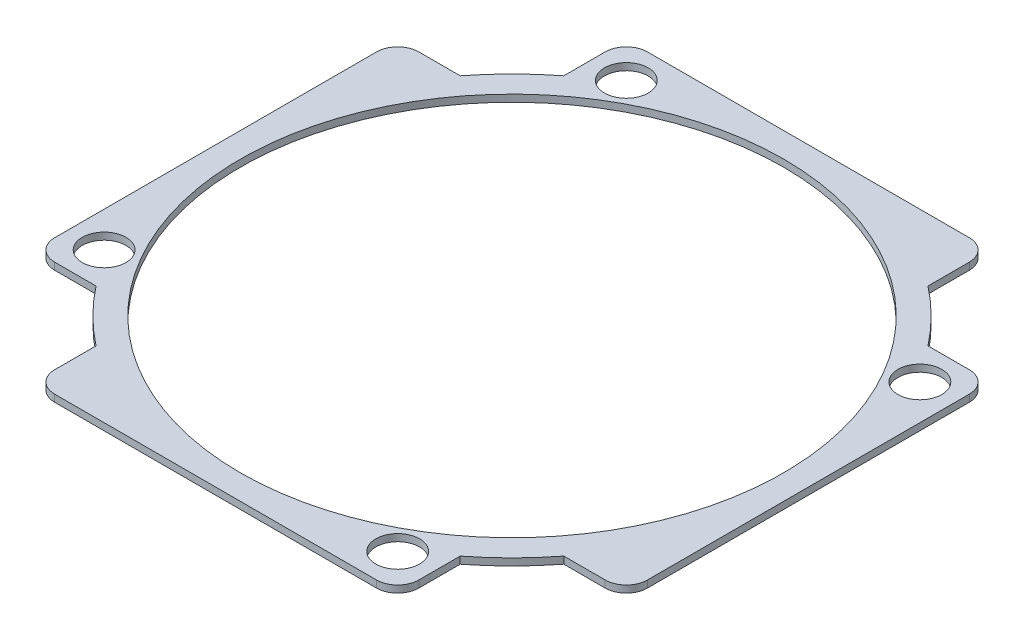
ISO-10303-21;
HEADER;
FILE_DESCRIPTION(('STEP AP214'),'2;1');
FILE_NAME('part.step','',(''),(''),'','','');
FILE_SCHEMA(('AUTOMOTIVE_DESIGN { 1 0 10303 214 1 1 1 1 }'));
ENDSEC;
DATA;
#1=APPLICATION_CONTEXT('core data for automotive mechanical design processes');
#2=APPLICATION_PROTOCOL_DEFINITION('international standard','automotive_design',2000,#1);
#3=PRODUCT_CONTEXT('',#1,'mechanical');
#4=PRODUCT('Part','Part','',(#3));
#5=PRODUCT_RELATED_PRODUCT_CATEGORY('part','',(#4));
#6=PRODUCT_DEFINITION_FORMATION('','',#4);
#7=PRODUCT_DEFINITION_CONTEXT('part definition',#1,'design');
#8=PRODUCT_DEFINITION('design','',#6,#7);
#9=PRODUCT_DEFINITION_SHAPE('','',#8);
#10=(LENGTH_UNIT() NAMED_UNIT(*) SI_UNIT(.MILLI.,.METRE.));
#11=(NAMED_UNIT(*) PLANE_ANGLE_UNIT() SI_UNIT($,.RADIAN.));
#12=(NAMED_UNIT(*) SI_UNIT($,.STERADIAN.) SOLID_ANGLE_UNIT());
#13=UNCERTAINTY_MEASURE_WITH_UNIT(LENGTH_MEASURE(1.E-05),#10,'distance_accuracy_value','');
#14=(GEOMETRIC_REPRESENTATION_CONTEXT(3) GLOBAL_UNCERTAINTY_ASSIGNED_CONTEXT((#13)) GLOBAL_UNIT_ASSIGNED_CONTEXT((#10,
#11,#12)) REPRESENTATION_CONTEXT('',''));
#15=CARTESIAN_POINT('',(0.,0.,0.));
#16=DIRECTION('',(0.,0.,1.));
#17=DIRECTION('',(1.,0.,0.));
#18=AXIS2_PLACEMENT_3D('',#15,#16,#17);
#19=CARTESIAN_POINT('',(-11.4,0.,19.5));
#20=DIRECTION('',(0.,1.,0.));
#21=DIRECTION('',(0.,0.,1.));
#22=AXIS2_PLACEMENT_3D('',#19,#20,#21);
#23=CYLINDRICAL_SURFACE('',#22,1.5);
#24=CARTESIAN_POINT('',(-11.4,0.499999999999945,19.5));
#25=DIRECTION('',(0.,1.,0.));
#26=DIRECTION('',(0.,0.,1.));
#27=AXIS2_PLACEMENT_3D('',#24,#25,#26);
#28=CIRCLE('',#27,1.5);
#29=CARTESIAN_POINT('',(-12.9,0.499999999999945,19.5));
#30=VERTEX_POINT('',#29);
#31=CARTESIAN_POINT('',(-11.4,0.499999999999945,21.));
#32=VERTEX_POINT('',#31);
#33=EDGE_CURVE('E225',#30,#32,#28,.T.);
#34=ORIENTED_EDGE('',*,*,#33,.F.);
#35=DIRECTION('',(0.,1.,0.));
#36=VECTOR('',#35,1.);
#37=CARTESIAN_POINT('',(-12.9,0.,19.5));
#38=LINE('',#37,#36);
#39=CARTESIAN_POINT('',(-12.9,0.,19.5));
#40=VERTEX_POINT('',#39);
#41=EDGE_CURVE('E11',#40,#30,#38,.T.);
#42=ORIENTED_EDGE('',*,*,#41,.F.);
#43=CARTESIAN_POINT('',(-11.4,0.,19.5));
#44=DIRECTION('',(0.,1.,0.));
#45=DIRECTION('',(0.,0.,1.));
#46=AXIS2_PLACEMENT_3D('',#43,#44,#45);
#47=CIRCLE('',#46,1.5);
#48=CARTESIAN_POINT('',(-11.4,0.,21.));
#49=VERTEX_POINT('',#48);
#50=EDGE_CURVE('E294',#40,#49,#47,.T.);
#51=ORIENTED_EDGE('',*,*,#50,.T.);
#52=DIRECTION('',(0.,1.,0.));
#53=VECTOR('',#52,1.);
#54=CARTESIAN_POINT('',(-11.4,0.,21.));
#55=LINE('',#54,#53);
#56=EDGE_CURVE('E35',#49,#32,#55,.T.);
#57=ORIENTED_EDGE('',*,*,#56,.T.);
#58=EDGE_LOOP('',(#34,#42,#51,#57));
#59=FACE_BOUND('',#58,.T.);
#60=ADVANCED_FACE('F32',(#59),#23,.T.);
#61=CARTESIAN_POINT('',(-12.9,0.,16.5707573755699));
#62=DIRECTION('',(-1.,0.,0.));
#63=DIRECTION('',(0.,0.,1.));
#64=AXIS2_PLACEMENT_3D('',#61,#62,#63);
#65=PLANE('',#64);
#66=DIRECTION('',(0.,0.,1.));
#67=VECTOR('',#66,1.);
#68=CARTESIAN_POINT('',(-12.9,0.499999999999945,16.5707573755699));
#69=LINE('',#68,#67);
#70=CARTESIAN_POINT('',(-12.9,0.499999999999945,16.5707573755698));
#71=VERTEX_POINT('',#70);
#72=EDGE_CURVE('E292',#71,#30,#69,.T.);
#73=ORIENTED_EDGE('',*,*,#72,.F.);
#74=DIRECTION('',(0.,1.,0.));
#75=VECTOR('',#74,1.);
#76=CARTESIAN_POINT('',(-12.9,0.,16.5707573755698));
#77=LINE('',#76,#75);
#78=CARTESIAN_POINT('',(-12.9,0.,16.5707573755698));
#79=VERTEX_POINT('',#78);
#80=EDGE_CURVE('E41',#79,#71,#77,.T.);
#81=ORIENTED_EDGE('',*,*,#80,.F.);
#82=DIRECTION('',(0.,0.,1.));
#83=VECTOR('',#82,1.);
#84=CARTESIAN_POINT('',(-12.9,0.,16.5707573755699));
#85=LINE('',#84,#83);
#86=EDGE_CURVE('E215',#79,#40,#85,.T.);
#87=ORIENTED_EDGE('',*,*,#86,.T.);
#88=ORIENTED_EDGE('',*,*,#41,.T.);
#89=EDGE_LOOP('',(#73,#81,#87,#88));
#90=FACE_BOUND('',#89,.T.);
#91=ADVANCED_FACE('F338',(#90),#65,.T.);
#92=CARTESIAN_POINT('',(0.,0.,0.));
#93=DIRECTION('',(0.,1.,0.));
#94=DIRECTION('',(0.,0.,1.));
#95=AXIS2_PLACEMENT_3D('',#92,#93,#94);
#96=CYLINDRICAL_SURFACE('',#95,21.);
#97=CARTESIAN_POINT('',(0.,0.499999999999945,0.));
#98=DIRECTION('',(0.,1.,0.));
#99=DIRECTION('',(0.,0.,1.));
#100=AXIS2_PLACEMENT_3D('',#97,#98,#99);
#101=CIRCLE('',#100,21.);
#102=CARTESIAN_POINT('',(-16.5707573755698,0.499999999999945,12.8999999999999));
#103=VERTEX_POINT('',#102);
#104=EDGE_CURVE('E202',#103,#71,#101,.T.);
#105=ORIENTED_EDGE('',*,*,#104,.F.);
#106=DIRECTION('',(0.,1.,0.));
#107=VECTOR('',#106,1.);
#108=CARTESIAN_POINT('',(-16.5707573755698,0.,12.8999999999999));
#109=LINE('',#108,#107);
#110=CARTESIAN_POINT('',(-16.5707573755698,0.,12.8999999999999));
#111=VERTEX_POINT('',#110);
#112=EDGE_CURVE('E197',#111,#103,#109,.T.);
#113=ORIENTED_EDGE('',*,*,#112,.F.);
#114=CARTESIAN_POINT('',(0.,0.,0.));
#115=DIRECTION('',(0.,1.,0.));
#116=DIRECTION('',(0.,0.,1.));
#117=AXIS2_PLACEMENT_3D('',#114,#115,#116);
#118=CIRCLE('',#117,21.);
#119=EDGE_CURVE('E200',#111,#79,#118,.T.);
#120=ORIENTED_EDGE('',*,*,#119,.T.);
#121=ORIENTED_EDGE('',*,*,#80,.T.);
#122=EDGE_LOOP('',(#105,#113,#120,#121));
#123=FACE_BOUND('',#122,.T.);
#124=ADVANCED_FACE('F199',(#123),#96,.T.);
#125=CARTESIAN_POINT('',(-19.5,0.,12.9));
#126=DIRECTION('',(0.,0.,1.));
#127=DIRECTION('',(1.,0.,0.));
#128=AXIS2_PLACEMENT_3D('',#125,#126,#127);
#129=PLANE('',#128);
#130=DIRECTION('',(1.,0.,0.));
#131=VECTOR('',#130,1.);
#132=CARTESIAN_POINT('',(-19.5,0.499999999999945,12.9));
#133=LINE('',#132,#131);
#134=CARTESIAN_POINT('',(-19.5,0.499999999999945,12.9));
#135=VERTEX_POINT('',#134);
#136=EDGE_CURVE('E289',#135,#103,#133,.T.);
#137=ORIENTED_EDGE('',*,*,#136,.F.);
#138=DIRECTION('',(0.,1.,0.));
#139=VECTOR('',#138,1.);
#140=CARTESIAN_POINT('',(-19.5,0.,12.9));
#141=LINE('',#140,#139);
#142=CARTESIAN_POINT('',(-19.5,0.,12.9));
#143=VERTEX_POINT('',#142);
#144=EDGE_CURVE('E207',#143,#135,#141,.T.);
#145=ORIENTED_EDGE('',*,*,#144,.F.);
#146=DIRECTION('',(1.,0.,0.));
#147=VECTOR('',#146,1.);
#148=CARTESIAN_POINT('',(-19.5,0.,12.9));
#149=LINE('',#148,#147);
#150=EDGE_CURVE('E213',#143,#111,#149,.T.);
#151=ORIENTED_EDGE('',*,*,#150,.T.);
#152=ORIENTED_EDGE('',*,*,#112,.T.);
#153=EDGE_LOOP('',(#137,#145,#151,#152));
#154=FACE_BOUND('',#153,.T.);
#155=ADVANCED_FACE('F217',(#154),#129,.T.);
#156=CARTESIAN_POINT('',(-19.5,0.,11.4));
#157=DIRECTION('',(0.,1.,0.));
#158=DIRECTION('',(0.,0.,1.));
#159=AXIS2_PLACEMENT_3D('',#156,#157,#158);
#160=CYLINDRICAL_SURFACE('',#159,1.5);
#161=CARTESIAN_POINT('',(-19.5,0.499999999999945,11.4));
#162=DIRECTION('',(0.,1.,0.));
#163=DIRECTION('',(0.,0.,1.));
#164=AXIS2_PLACEMENT_3D('',#161,#162,#163);
#165=CIRCLE('',#164,1.5);
#166=CARTESIAN_POINT('',(-21.,0.499999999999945,11.4));
#167=VERTEX_POINT('',#166);
#168=EDGE_CURVE('E286',#167,#135,#165,.T.);
#169=ORIENTED_EDGE('',*,*,#168,.F.);
#170=DIRECTION('',(0.,1.,0.));
#171=VECTOR('',#170,1.);
#172=CARTESIAN_POINT('',(-21.,0.,11.4));
#173=LINE('',#172,#171);
#174=CARTESIAN_POINT('',(-21.,0.,11.4));
#175=VERTEX_POINT('',#174);
#176=EDGE_CURVE('E298',#175,#167,#173,.T.);
#177=ORIENTED_EDGE('',*,*,#176,.F.);
#178=CARTESIAN_POINT('',(-19.5,0.,11.4));
#179=DIRECTION('',(0.,1.,0.));
#180=DIRECTION('',(0.,0.,1.));
#181=AXIS2_PLACEMENT_3D('',#178,#179,#180);
#182=CIRCLE('',#181,1.5);
#183=EDGE_CURVE('E218',#175,#143,#182,.T.);
#184=ORIENTED_EDGE('',*,*,#183,.T.);
#185=ORIENTED_EDGE('',*,*,#144,.T.);
#186=EDGE_LOOP('',(#169,#177,#184,#185));
#187=FACE_BOUND('',#186,.T.);
#188=ADVANCED_FACE('F351',(#187),#160,.T.);
#189=CARTESIAN_POINT('',(-21.,0.,-11.4));
#190=DIRECTION('',(-1.,0.,0.));
#191=DIRECTION('',(0.,0.,1.));
#192=AXIS2_PLACEMENT_3D('',#189,#190,#191);
#193=PLANE('',#192);
#194=DIRECTION('',(0.,0.,1.));
#195=VECTOR('',#194,1.);
#196=CARTESIAN_POINT('',(-21.,0.499999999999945,-11.4));
#197=LINE('',#196,#195);
#198=CARTESIAN_POINT('',(-21.,0.499999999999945,-11.4));
#199=VERTEX_POINT('',#198);
#200=EDGE_CURVE('E283',#199,#167,#197,.T.);
#201=ORIENTED_EDGE('',*,*,#200,.F.);
#202=DIRECTION('',(0.,1.,0.));
#203=VECTOR('',#202,1.);
#204=CARTESIAN_POINT('',(-21.,0.,-11.4));
#205=LINE('',#204,#203);
#206=CARTESIAN_POINT('',(-21.,0.,-11.4));
#207=VERTEX_POINT('',#206);
#208=EDGE_CURVE('E300',#207,#199,#205,.T.);
#209=ORIENTED_EDGE('',*,*,#208,.F.);
#210=DIRECTION('',(0.,0.,1.));
#211=VECTOR('',#210,1.);
#212=CARTESIAN_POINT('',(-21.,0.,-11.4));
#213=LINE('',#212,#211);
#214=EDGE_CURVE('E220',#207,#175,#213,.T.);
#215=ORIENTED_EDGE('',*,*,#214,.T.);
#216=ORIENTED_EDGE('',*,*,#176,.T.);
#217=EDGE_LOOP('',(#201,#209,#215,#216));
#218=FACE_BOUND('',#217,.T.);
#219=ADVANCED_FACE('F354',(#218),#193,.T.);
#220=CARTESIAN_POINT('',(-19.5,0.,-11.4));
#221=DIRECTION('',(0.,1.,0.));
#222=DIRECTION('',(0.,0.,1.));
#223=AXIS2_PLACEMENT_3D('',#220,#221,#222);
#224=CYLINDRICAL_SURFACE('',#223,1.5);
#225=CARTESIAN_POINT('',(-19.5,0.499999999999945,-11.4));
#226=DIRECTION('',(0.,1.,0.));
#227=DIRECTION('',(0.,0.,1.));
#228=AXIS2_PLACEMENT_3D('',#225,#226,#227);
#229=CIRCLE('',#228,1.5);
#230=CARTESIAN_POINT('',(-19.5,0.499999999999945,-12.9));
#231=VERTEX_POINT('',#230);
#232=EDGE_CURVE('E280',#231,#199,#229,.T.);
#233=ORIENTED_EDGE('',*,*,#232,.F.);
#234=DIRECTION('',(0.,1.,0.));
#235=VECTOR('',#234,1.);
#236=CARTESIAN_POINT('',(-19.5,0.,-12.9));
#237=LINE('',#236,#235);
#238=CARTESIAN_POINT('',(-19.5,0.,-12.9));
#239=VERTEX_POINT('',#238);
#240=EDGE_CURVE('E302',#239,#231,#237,.T.);
#241=ORIENTED_EDGE('',*,*,#240,.F.);
#242=CARTESIAN_POINT('',(-19.5,0.,-11.4));
#243=DIRECTION('',(0.,1.,0.));
#244=DIRECTION('',(0.,0.,1.));
#245=AXIS2_PLACEMENT_3D('',#242,#243,#244);
#246=CIRCLE('',#245,1.5);
#247=EDGE_CURVE('E542',#239,#207,#246,.T.);
#248=ORIENTED_EDGE('',*,*,#247,.T.);
#249=ORIENTED_EDGE('',*,*,#208,.T.);
#250=EDGE_LOOP('',(#233,#241,#248,#249));
#251=FACE_BOUND('',#250,.T.);
#252=ADVANCED_FACE('F358',(#251),#224,.T.);
#253=CARTESIAN_POINT('',(-16.5707573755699,0.,-12.9));
#254=DIRECTION('',(0.,0.,-1.));
#255=DIRECTION('',(-1.,0.,0.));
#256=AXIS2_PLACEMENT_3D('',#253,#254,#255);
#257=PLANE('',#256);
#258=DIRECTION('',(-1.,0.,0.));
#259=VECTOR('',#258,1.);
#260=CARTESIAN_POINT('',(-16.5707573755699,0.499999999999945,-12.9));
#261=LINE('',#260,#259);
#262=CARTESIAN_POINT('',(-16.5707573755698,0.499999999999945,-12.9));
#263=VERTEX_POINT('',#262);
#264=EDGE_CURVE('E277',#263,#231,#261,.T.);
#265=ORIENTED_EDGE('',*,*,#264,.F.);
#266=DIRECTION('',(0.,1.,0.));
#267=VECTOR('',#266,1.);
#268=CARTESIAN_POINT('',(-16.5707573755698,0.,-12.9));
#269=LINE('',#268,#267);
#270=CARTESIAN_POINT('',(-16.5707573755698,0.,-12.9));
#271=VERTEX_POINT('',#270);
#272=EDGE_CURVE('E304',#271,#263,#269,.T.);
#273=ORIENTED_EDGE('',*,*,#272,.F.);
#274=DIRECTION('',(-1.,0.,0.));
#275=VECTOR('',#274,1.);
#276=CARTESIAN_POINT('',(-16.5707573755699,0.,-12.9));
#277=LINE('',#276,#275);
#278=EDGE_CURVE('E539',#271,#239,#277,.T.);
#279=ORIENTED_EDGE('',*,*,#278,.T.);
#280=ORIENTED_EDGE('',*,*,#240,.T.);
#281=EDGE_LOOP('',(#265,#273,#279,#280));
#282=FACE_BOUND('',#281,.T.);
#283=ADVANCED_FACE('F362',(#282),#257,.T.);
#284=CARTESIAN_POINT('',(0.,0.,0.));
#285=DIRECTION('',(0.,1.,0.));
#286=DIRECTION('',(0.,0.,1.));
#287=AXIS2_PLACEMENT_3D('',#284,#285,#286);
#288=CYLINDRICAL_SURFACE('',#287,21.);
#289=CARTESIAN_POINT('',(0.,0.499999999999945,0.));
#290=DIRECTION('',(0.,1.,0.));
#291=DIRECTION('',(0.,0.,1.));
#292=AXIS2_PLACEMENT_3D('',#289,#290,#291);
#293=CIRCLE('',#292,21.);
#294=CARTESIAN_POINT('',(-12.8999999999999,0.499999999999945,-16.5707573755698));
#295=VERTEX_POINT('',#294);
#296=EDGE_CURVE('E274',#295,#263,#293,.T.);
#297=ORIENTED_EDGE('',*,*,#296,.F.);
#298=DIRECTION('',(0.,1.,0.));
#299=VECTOR('',#298,1.);
#300=CARTESIAN_POINT('',(-12.8999999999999,0.,-16.5707573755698));
#301=LINE('',#300,#299);
#302=CARTESIAN_POINT('',(-12.8999999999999,0.,-16.5707573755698));
#303=VERTEX_POINT('',#302);
#304=EDGE_CURVE('E306',#303,#295,#301,.T.);
#305=ORIENTED_EDGE('',*,*,#304,.F.);
#306=CARTESIAN_POINT('',(0.,0.,0.));
#307=DIRECTION('',(0.,1.,0.));
#308=DIRECTION('',(0.,0.,1.));
#309=AXIS2_PLACEMENT_3D('',#306,#307,#308);
#310=CIRCLE('',#309,21.);
#311=EDGE_CURVE('E536',#303,#271,#310,.T.);
#312=ORIENTED_EDGE('',*,*,#311,.T.);
#313=ORIENTED_EDGE('',*,*,#272,.T.);
#314=EDGE_LOOP('',(#297,#305,#312,#313));
#315=FACE_BOUND('',#314,.T.);
#316=ADVANCED_FACE('F366',(#315),#288,.T.);
#317=CARTESIAN_POINT('',(-12.9,0.,-19.5));
#318=DIRECTION('',(-1.,0.,0.));
#319=DIRECTION('',(0.,0.,1.));
#320=AXIS2_PLACEMENT_3D('',#317,#318,#319);
#321=PLANE('',#320);
#322=DIRECTION('',(0.,0.,1.));
#323=VECTOR('',#322,1.);
#324=CARTESIAN_POINT('',(-12.9,0.499999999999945,-19.5));
#325=LINE('',#324,#323);
#326=CARTESIAN_POINT('',(-12.9,0.499999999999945,-19.5));
#327=VERTEX_POINT('',#326);
#328=EDGE_CURVE('E271',#327,#295,#325,.T.);
#329=ORIENTED_EDGE('',*,*,#328,.F.);
#330=DIRECTION('',(0.,1.,0.));
#331=VECTOR('',#330,1.);
#332=CARTESIAN_POINT('',(-12.9,0.,-19.5));
#333=LINE('',#332,#331);
#334=CARTESIAN_POINT('',(-12.9,0.,-19.5));
#335=VERTEX_POINT('',#334);
#336=EDGE_CURVE('E308',#335,#327,#333,.T.);
#337=ORIENTED_EDGE('',*,*,#336,.F.);
#338=DIRECTION('',(0.,0.,1.));
#339=VECTOR('',#338,1.);
#340=CARTESIAN_POINT('',(-12.9,0.,-19.5));
#341=LINE('',#340,#339);
#342=EDGE_CURVE('E533',#335,#303,#341,.T.);
#343=ORIENTED_EDGE('',*,*,#342,.T.);
#344=ORIENTED_EDGE('',*,*,#304,.T.);
#345=EDGE_LOOP('',(#329,#337,#343,#344));
#346=FACE_BOUND('',#345,.T.);
#347=ADVANCED_FACE('F370',(#346),#321,.T.);
#348=CARTESIAN_POINT('',(-11.4,0.,-19.5));
#349=DIRECTION('',(0.,1.,0.));
#350=DIRECTION('',(0.,0.,1.));
#351=AXIS2_PLACEMENT_3D('',#348,#349,#350);
#352=CYLINDRICAL_SURFACE('',#351,1.5);
#353=CARTESIAN_POINT('',(-11.4,0.499999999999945,-19.5));
#354=DIRECTION('',(0.,1.,0.));
#355=DIRECTION('',(0.,0.,1.));
#356=AXIS2_PLACEMENT_3D('',#353,#354,#355);
#357=CIRCLE('',#356,1.5);
#358=CARTESIAN_POINT('',(-11.4,0.499999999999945,-21.));
#359=VERTEX_POINT('',#358);
#360=EDGE_CURVE('E268',#359,#327,#357,.T.);
#361=ORIENTED_EDGE('',*,*,#360,.F.);
#362=DIRECTION('',(0.,1.,0.));
#363=VECTOR('',#362,1.);
#364=CARTESIAN_POINT('',(-11.4,0.,-21.));
#365=LINE('',#364,#363);
#366=CARTESIAN_POINT('',(-11.4,0.,-21.));
#367=VERTEX_POINT('',#366);
#368=EDGE_CURVE('E310',#367,#359,#365,.T.);
#369=ORIENTED_EDGE('',*,*,#368,.F.);
#370=CARTESIAN_POINT('',(-11.4,0.,-19.5));
#371=DIRECTION('',(0.,1.,0.));
#372=DIRECTION('',(0.,0.,1.));
#373=AXIS2_PLACEMENT_3D('',#370,#371,#372);
#374=CIRCLE('',#373,1.5);
#375=EDGE_CURVE('E530',#367,#335,#374,.T.);
#376=ORIENTED_EDGE('',*,*,#375,.T.);
#377=ORIENTED_EDGE('',*,*,#336,.T.);
#378=EDGE_LOOP('',(#361,#369,#376,#377));
#379=FACE_BOUND('',#378,.T.);
#380=ADVANCED_FACE('F374',(#379),#352,.T.);
#381=CARTESIAN_POINT('',(11.4,0.,-21.));
#382=DIRECTION('',(0.,0.,-1.));
#383=DIRECTION('',(-1.,0.,0.));
#384=AXIS2_PLACEMENT_3D('',#381,#382,#383);
#385=PLANE('',#384);
#386=DIRECTION('',(-1.,0.,0.));
#387=VECTOR('',#386,1.);
#388=CARTESIAN_POINT('',(11.4,0.499999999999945,-21.));
#389=LINE('',#388,#387);
#390=CARTESIAN_POINT('',(11.4,0.499999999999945,-21.));
#391=VERTEX_POINT('',#390);
#392=EDGE_CURVE('E265',#391,#359,#389,.T.);
#393=ORIENTED_EDGE('',*,*,#392,.F.);
#394=DIRECTION('',(0.,1.,0.));
#395=VECTOR('',#394,1.);
#396=CARTESIAN_POINT('',(11.4,0.,-21.));
#397=LINE('',#396,#395);
#398=CARTESIAN_POINT('',(11.4,0.,-21.));
#399=VERTEX_POINT('',#398);
#400=EDGE_CURVE('E312',#399,#391,#397,.T.);
#401=ORIENTED_EDGE('',*,*,#400,.F.);
#402=DIRECTION('',(-1.,0.,0.));
#403=VECTOR('',#402,1.);
#404=CARTESIAN_POINT('',(11.4,0.,-21.));
#405=LINE('',#404,#403);
#406=EDGE_CURVE('E527',#399,#367,#405,.T.);
#407=ORIENTED_EDGE('',*,*,#406,.T.);
#408=ORIENTED_EDGE('',*,*,#368,.T.);
#409=EDGE_LOOP('',(#393,#401,#407,#408));
#410=FACE_BOUND('',#409,.T.);
#411=ADVANCED_FACE('F378',(#410),#385,.T.);
#412=CARTESIAN_POINT('',(11.4,0.,-19.5));
#413=DIRECTION('',(0.,1.,0.));
#414=DIRECTION('',(0.,0.,1.));
#415=AXIS2_PLACEMENT_3D('',#412,#413,#414);
#416=CYLINDRICAL_SURFACE('',#415,1.5);
#417=CARTESIAN_POINT('',(11.4,0.499999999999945,-19.5));
#418=DIRECTION('',(0.,1.,0.));
#419=DIRECTION('',(0.,0.,1.));
#420=AXIS2_PLACEMENT_3D('',#417,#418,#419);
#421=CIRCLE('',#420,1.5);
#422=CARTESIAN_POINT('',(12.9,0.499999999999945,-19.5));
#423=VERTEX_POINT('',#422);
#424=EDGE_CURVE('E262',#423,#391,#421,.T.);
#425=ORIENTED_EDGE('',*,*,#424,.F.);
#426=DIRECTION('',(0.,1.,0.));
#427=VECTOR('',#426,1.);
#428=CARTESIAN_POINT('',(12.9,0.,-19.5));
#429=LINE('',#428,#427);
#430=CARTESIAN_POINT('',(12.9,0.,-19.5));
#431=VERTEX_POINT('',#430);
#432=EDGE_CURVE('E314',#431,#423,#429,.T.);
#433=ORIENTED_EDGE('',*,*,#432,.F.);
#434=CARTESIAN_POINT('',(11.4,0.,-19.5));
#435=DIRECTION('',(0.,1.,0.));
#436=DIRECTION('',(0.,0.,1.));
#437=AXIS2_PLACEMENT_3D('',#434,#435,#436);
#438=CIRCLE('',#437,1.5);
#439=EDGE_CURVE('E524',#431,#399,#438,.T.);
#440=ORIENTED_EDGE('',*,*,#439,.T.);
#441=ORIENTED_EDGE('',*,*,#400,.T.);
#442=EDGE_LOOP('',(#425,#433,#440,#441));
#443=FACE_BOUND('',#442,.T.);
#444=ADVANCED_FACE('F382',(#443),#416,.T.);
#445=CARTESIAN_POINT('',(12.9,0.,-16.5707573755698));
#446=DIRECTION('',(1.,0.,0.));
#447=DIRECTION('',(0.,0.,-1.));
#448=AXIS2_PLACEMENT_3D('',#445,#446,#447);
#449=PLANE('',#448);
#450=DIRECTION('',(0.,0.,-1.));
#451=VECTOR('',#450,1.);
#452=CARTESIAN_POINT('',(12.9,0.499999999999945,-16.5707573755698));
#453=LINE('',#452,#451);
#454=CARTESIAN_POINT('',(12.9,0.499999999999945,-16.5707573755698));
#455=VERTEX_POINT('',#454);
#456=EDGE_CURVE('E259',#455,#423,#453,.T.);
#457=ORIENTED_EDGE('',*,*,#456,.F.);
#458=DIRECTION('',(0.,1.,0.));
#459=VECTOR('',#458,1.);
#460=CARTESIAN_POINT('',(12.9,0.,-16.5707573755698));
#461=LINE('',#460,#459);
#462=CARTESIAN_POINT('',(12.9,0.,-16.5707573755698));
#463=VERTEX_POINT('',#462);
#464=EDGE_CURVE('E316',#463,#455,#461,.T.);
#465=ORIENTED_EDGE('',*,*,#464,.F.);
#466=DIRECTION('',(0.,0.,-1.));
#467=VECTOR('',#466,1.);
#468=CARTESIAN_POINT('',(12.9,0.,-16.5707573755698));
#469=LINE('',#468,#467);
#470=EDGE_CURVE('E521',#463,#431,#469,.T.);
#471=ORIENTED_EDGE('',*,*,#470,.T.);
#472=ORIENTED_EDGE('',*,*,#432,.T.);
#473=EDGE_LOOP('',(#457,#465,#471,#472));
#474=FACE_BOUND('',#473,.T.);
#475=ADVANCED_FACE('F386',(#474),#449,.T.);
#476=CARTESIAN_POINT('',(0.,0.,0.));
#477=DIRECTION('',(0.,1.,0.));
#478=DIRECTION('',(0.,0.,1.));
#479=AXIS2_PLACEMENT_3D('',#476,#477,#478);
#480=CYLINDRICAL_SURFACE('',#479,21.);
#481=CARTESIAN_POINT('',(0.,0.499999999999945,0.));
#482=DIRECTION('',(0.,1.,0.));
#483=DIRECTION('',(0.,0.,1.));
#484=AXIS2_PLACEMENT_3D('',#481,#482,#483);
#485=CIRCLE('',#484,21.);
#486=CARTESIAN_POINT('',(16.5707573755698,0.499999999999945,-12.8999999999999));
#487=VERTEX_POINT('',#486);
#488=EDGE_CURVE('E256',#487,#455,#485,.T.);
#489=ORIENTED_EDGE('',*,*,#488,.F.);
#490=DIRECTION('',(0.,1.,0.));
#491=VECTOR('',#490,1.);
#492=CARTESIAN_POINT('',(16.5707573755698,0.,-12.8999999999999));
#493=LINE('',#492,#491);
#494=CARTESIAN_POINT('',(16.5707573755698,0.,-12.8999999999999));
#495=VERTEX_POINT('',#494);
#496=EDGE_CURVE('E318',#495,#487,#493,.T.);
#497=ORIENTED_EDGE('',*,*,#496,.F.);
#498=CARTESIAN_POINT('',(0.,0.,0.));
#499=DIRECTION('',(0.,1.,0.));
#500=DIRECTION('',(0.,0.,1.));
#501=AXIS2_PLACEMENT_3D('',#498,#499,#500);
#502=CIRCLE('',#501,21.);
#503=EDGE_CURVE('E518',#495,#463,#502,.T.);
#504=ORIENTED_EDGE('',*,*,#503,.T.);
#505=ORIENTED_EDGE('',*,*,#464,.T.);
#506=EDGE_LOOP('',(#489,#497,#504,#505));
#507=FACE_BOUND('',#506,.T.);
#508=ADVANCED_FACE('F390',(#507),#480,.T.);
#509=CARTESIAN_POINT('',(19.5,0.,-12.9));
#510=DIRECTION('',(0.,0.,-1.));
#511=DIRECTION('',(-1.,0.,0.));
#512=AXIS2_PLACEMENT_3D('',#509,#510,#511);
#513=PLANE('',#512);
#514=DIRECTION('',(-1.,0.,0.));
#515=VECTOR('',#514,1.);
#516=CARTESIAN_POINT('',(19.5,0.499999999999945,-12.9));
#517=LINE('',#516,#515);
#518=CARTESIAN_POINT('',(19.5,0.499999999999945,-12.9));
#519=VERTEX_POINT('',#518);
#520=EDGE_CURVE('E253',#519,#487,#517,.T.);
#521=ORIENTED_EDGE('',*,*,#520,.F.);
#522=DIRECTION('',(0.,1.,0.));
#523=VECTOR('',#522,1.);
#524=CARTESIAN_POINT('',(19.5,0.,-12.9));
#525=LINE('',#524,#523);
#526=CARTESIAN_POINT('',(19.5,0.,-12.9));
#527=VERTEX_POINT('',#526);
#528=EDGE_CURVE('E320',#527,#519,#525,.T.);
#529=ORIENTED_EDGE('',*,*,#528,.F.);
#530=DIRECTION('',(-1.,0.,0.));
#531=VECTOR('',#530,1.);
#532=CARTESIAN_POINT('',(19.5,0.,-12.9));
#533=LINE('',#532,#531);
#534=EDGE_CURVE('E515',#527,#495,#533,.T.);
#535=ORIENTED_EDGE('',*,*,#534,.T.);
#536=ORIENTED_EDGE('',*,*,#496,.T.);
#537=EDGE_LOOP('',(#521,#529,#535,#536));
#538=FACE_BOUND('',#537,.T.);
#539=ADVANCED_FACE('F394',(#538),#513,.T.);
#540=CARTESIAN_POINT('',(19.5,0.,-11.4));
#541=DIRECTION('',(0.,1.,0.));
#542=DIRECTION('',(0.,0.,1.));
#543=AXIS2_PLACEMENT_3D('',#540,#541,#542);
#544=CYLINDRICAL_SURFACE('',#543,1.5);
#545=CARTESIAN_POINT('',(19.5,0.499999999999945,-11.4));
#546=DIRECTION('',(0.,1.,0.));
#547=DIRECTION('',(0.,0.,1.));
#548=AXIS2_PLACEMENT_3D('',#545,#546,#547);
#549=CIRCLE('',#548,1.5);
#550=CARTESIAN_POINT('',(21.,0.499999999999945,-11.4));
#551=VERTEX_POINT('',#550);
#552=EDGE_CURVE('E250',#551,#519,#549,.T.);
#553=ORIENTED_EDGE('',*,*,#552,.F.);
#554=DIRECTION('',(0.,1.,0.));
#555=VECTOR('',#554,1.);
#556=CARTESIAN_POINT('',(21.,0.,-11.4));
#557=LINE('',#556,#555);
#558=CARTESIAN_POINT('',(21.,0.,-11.4));
#559=VERTEX_POINT('',#558);
#560=EDGE_CURVE('E322',#559,#551,#557,.T.);
#561=ORIENTED_EDGE('',*,*,#560,.F.);
#562=CARTESIAN_POINT('',(19.5,0.,-11.4));
#563=DIRECTION('',(0.,1.,0.));
#564=DIRECTION('',(0.,0.,1.));
#565=AXIS2_PLACEMENT_3D('',#562,#563,#564);
#566=CIRCLE('',#565,1.5);
#567=EDGE_CURVE('E512',#559,#527,#566,.T.);
#568=ORIENTED_EDGE('',*,*,#567,.T.);
#569=ORIENTED_EDGE('',*,*,#528,.T.);
#570=EDGE_LOOP('',(#553,#561,#568,#569));
#571=FACE_BOUND('',#570,.T.);
#572=ADVANCED_FACE('F398',(#571),#544,.T.);
#573=CARTESIAN_POINT('',(21.,0.,11.4));
#574=DIRECTION('',(1.,0.,0.));
#575=DIRECTION('',(0.,0.,-1.));
#576=AXIS2_PLACEMENT_3D('',#573,#574,#575);
#577=PLANE('',#576);
#578=DIRECTION('',(0.,0.,-1.));
#579=VECTOR('',#578,1.);
#580=CARTESIAN_POINT('',(21.,0.499999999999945,11.4));
#581=LINE('',#580,#579);
#582=CARTESIAN_POINT('',(21.,0.499999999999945,11.4));
#583=VERTEX_POINT('',#582);
#584=EDGE_CURVE('E247',#583,#551,#581,.T.);
#585=ORIENTED_EDGE('',*,*,#584,.F.);
#586=DIRECTION('',(0.,1.,0.));
#587=VECTOR('',#586,1.);
#588=CARTESIAN_POINT('',(21.,0.,11.4));
#589=LINE('',#588,#587);
#590=CARTESIAN_POINT('',(21.,0.,11.4));
#591=VERTEX_POINT('',#590);
#592=EDGE_CURVE('E324',#591,#583,#589,.T.);
#593=ORIENTED_EDGE('',*,*,#592,.F.);
#594=DIRECTION('',(0.,0.,-1.));
#595=VECTOR('',#594,1.);
#596=CARTESIAN_POINT('',(21.,0.,11.4));
#597=LINE('',#596,#595);
#598=EDGE_CURVE('E509',#591,#559,#597,.T.);
#599=ORIENTED_EDGE('',*,*,#598,.T.);
#600=ORIENTED_EDGE('',*,*,#560,.T.);
#601=EDGE_LOOP('',(#585,#593,#599,#600));
#602=FACE_BOUND('',#601,.T.);
#603=ADVANCED_FACE('F402',(#602),#577,.T.);
#604=CARTESIAN_POINT('',(19.5,0.,11.4));
#605=DIRECTION('',(0.,1.,0.));
#606=DIRECTION('',(0.,0.,1.));
#607=AXIS2_PLACEMENT_3D('',#604,#605,#606);
#608=CYLINDRICAL_SURFACE('',#607,1.5);
#609=CARTESIAN_POINT('',(19.5,0.499999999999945,11.4));
#610=DIRECTION('',(0.,1.,0.));
#611=DIRECTION('',(0.,0.,1.));
#612=AXIS2_PLACEMENT_3D('',#609,#610,#611);
#613=CIRCLE('',#612,1.5);
#614=CARTESIAN_POINT('',(19.5,0.499999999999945,12.9));
#615=VERTEX_POINT('',#614);
#616=EDGE_CURVE('E244',#615,#583,#613,.T.);
#617=ORIENTED_EDGE('',*,*,#616,.F.);
#618=DIRECTION('',(0.,1.,0.));
#619=VECTOR('',#618,1.);
#620=CARTESIAN_POINT('',(19.5,0.,12.9));
#621=LINE('',#620,#619);
#622=CARTESIAN_POINT('',(19.5,0.,12.9));
#623=VERTEX_POINT('',#622);
#624=EDGE_CURVE('E326',#623,#615,#621,.T.);
#625=ORIENTED_EDGE('',*,*,#624,.F.);
#626=CARTESIAN_POINT('',(19.5,0.,11.4));
#627=DIRECTION('',(0.,1.,0.));
#628=DIRECTION('',(0.,0.,1.));
#629=AXIS2_PLACEMENT_3D('',#626,#627,#628);
#630=CIRCLE('',#629,1.5);
#631=EDGE_CURVE('E506',#623,#591,#630,.T.);
#632=ORIENTED_EDGE('',*,*,#631,.T.);
#633=ORIENTED_EDGE('',*,*,#592,.T.);
#634=EDGE_LOOP('',(#617,#625,#632,#633));
#635=FACE_BOUND('',#634,.T.);
#636=ADVANCED_FACE('F406',(#635),#608,.T.);
#637=CARTESIAN_POINT('',(16.5707573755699,0.,12.9));
#638=DIRECTION('',(0.,0.,1.));
#639=DIRECTION('',(1.,0.,0.));
#640=AXIS2_PLACEMENT_3D('',#637,#638,#639);
#641=PLANE('',#640);
#642=DIRECTION('',(1.,0.,0.));
#643=VECTOR('',#642,1.);
#644=CARTESIAN_POINT('',(16.5707573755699,0.499999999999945,12.9));
#645=LINE('',#644,#643);
#646=CARTESIAN_POINT('',(16.5707573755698,0.499999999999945,12.9));
#647=VERTEX_POINT('',#646);
#648=EDGE_CURVE('E241',#647,#615,#645,.T.);
#649=ORIENTED_EDGE('',*,*,#648,.F.);
#650=DIRECTION('',(0.,1.,0.));
#651=VECTOR('',#650,1.);
#652=CARTESIAN_POINT('',(16.5707573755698,0.,12.9));
#653=LINE('',#652,#651);
#654=CARTESIAN_POINT('',(16.5707573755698,0.,12.9));
#655=VERTEX_POINT('',#654);
#656=EDGE_CURVE('E328',#655,#647,#653,.T.);
#657=ORIENTED_EDGE('',*,*,#656,.F.);
#658=DIRECTION('',(1.,0.,0.));
#659=VECTOR('',#658,1.);
#660=CARTESIAN_POINT('',(16.5707573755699,0.,12.9));
#661=LINE('',#660,#659);
#662=EDGE_CURVE('E503',#655,#623,#661,.T.);
#663=ORIENTED_EDGE('',*,*,#662,.T.);
#664=ORIENTED_EDGE('',*,*,#624,.T.);
#665=EDGE_LOOP('',(#649,#657,#663,#664));
#666=FACE_BOUND('',#665,.T.);
#667=ADVANCED_FACE('F410',(#666),#641,.T.);
#668=CARTESIAN_POINT('',(0.,0.,0.));
#669=DIRECTION('',(0.,1.,0.));
#670=DIRECTION('',(0.,0.,1.));
#671=AXIS2_PLACEMENT_3D('',#668,#669,#670);
#672=CYLINDRICAL_SURFACE('',#671,21.);
#673=CARTESIAN_POINT('',(0.,0.499999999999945,0.));
#674=DIRECTION('',(0.,1.,0.));
#675=DIRECTION('',(0.,0.,1.));
#676=AXIS2_PLACEMENT_3D('',#673,#674,#675);
#677=CIRCLE('',#676,21.);
#678=CARTESIAN_POINT('',(12.8999999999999,0.499999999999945,16.5707573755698));
#679=VERTEX_POINT('',#678);
#680=EDGE_CURVE('E238',#679,#647,#677,.T.);
#681=ORIENTED_EDGE('',*,*,#680,.F.);
#682=DIRECTION('',(0.,1.,0.));
#683=VECTOR('',#682,1.);
#684=CARTESIAN_POINT('',(12.8999999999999,0.,16.5707573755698));
#685=LINE('',#684,#683);
#686=CARTESIAN_POINT('',(12.8999999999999,0.,16.5707573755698));
#687=VERTEX_POINT('',#686);
#688=EDGE_CURVE('E330',#687,#679,#685,.T.);
#689=ORIENTED_EDGE('',*,*,#688,.F.);
#690=CARTESIAN_POINT('',(0.,0.,0.));
#691=DIRECTION('',(0.,1.,0.));
#692=DIRECTION('',(0.,0.,1.));
#693=AXIS2_PLACEMENT_3D('',#690,#691,#692);
#694=CIRCLE('',#693,21.);
#695=EDGE_CURVE('E500',#687,#655,#694,.T.);
#696=ORIENTED_EDGE('',*,*,#695,.T.);
#697=ORIENTED_EDGE('',*,*,#656,.T.);
#698=EDGE_LOOP('',(#681,#689,#696,#697));
#699=FACE_BOUND('',#698,.T.);
#700=ADVANCED_FACE('F414',(#699),#672,.T.);
#701=CARTESIAN_POINT('',(12.9,0.,19.5));
#702=DIRECTION('',(1.,0.,0.));
#703=DIRECTION('',(0.,0.,-1.));
#704=AXIS2_PLACEMENT_3D('',#701,#702,#703);
#705=PLANE('',#704);
#706=DIRECTION('',(0.,0.,-1.));
#707=VECTOR('',#706,1.);
#708=CARTESIAN_POINT('',(12.9,0.499999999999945,19.5));
#709=LINE('',#708,#707);
#710=CARTESIAN_POINT('',(12.9,0.499999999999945,19.5));
#711=VERTEX_POINT('',#710);
#712=EDGE_CURVE('E235',#711,#679,#709,.T.);
#713=ORIENTED_EDGE('',*,*,#712,.F.);
#714=DIRECTION('',(0.,1.,0.));
#715=VECTOR('',#714,1.);
#716=CARTESIAN_POINT('',(12.9,0.,19.5));
#717=LINE('',#716,#715);
#718=CARTESIAN_POINT('',(12.9,0.,19.5));
#719=VERTEX_POINT('',#718);
#720=EDGE_CURVE('E332',#719,#711,#717,.T.);
#721=ORIENTED_EDGE('',*,*,#720,.F.);
#722=DIRECTION('',(0.,0.,-1.));
#723=VECTOR('',#722,1.);
#724=CARTESIAN_POINT('',(12.9,0.,19.5));
#725=LINE('',#724,#723);
#726=EDGE_CURVE('E497',#719,#687,#725,.T.);
#727=ORIENTED_EDGE('',*,*,#726,.T.);
#728=ORIENTED_EDGE('',*,*,#688,.T.);
#729=EDGE_LOOP('',(#713,#721,#727,#728));
#730=FACE_BOUND('',#729,.T.);
#731=ADVANCED_FACE('F418',(#730),#705,.T.);
#732=CARTESIAN_POINT('',(11.4,0.,19.5));
#733=DIRECTION('',(0.,1.,0.));
#734=DIRECTION('',(0.,0.,1.));
#735=AXIS2_PLACEMENT_3D('',#732,#733,#734);
#736=CYLINDRICAL_SURFACE('',#735,1.5);
#737=CARTESIAN_POINT('',(11.4,0.499999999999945,19.5));
#738=DIRECTION('',(0.,1.,0.));
#739=DIRECTION('',(0.,0.,1.));
#740=AXIS2_PLACEMENT_3D('',#737,#738,#739);
#741=CIRCLE('',#740,1.5);
#742=CARTESIAN_POINT('',(11.4,0.499999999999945,21.));
#743=VERTEX_POINT('',#742);
#744=EDGE_CURVE('E232',#743,#711,#741,.T.);
#745=ORIENTED_EDGE('',*,*,#744,.F.);
#746=DIRECTION('',(0.,1.,0.));
#747=VECTOR('',#746,1.);
#748=CARTESIAN_POINT('',(11.4,0.,21.));
#749=LINE('',#748,#747);
#750=CARTESIAN_POINT('',(11.4,0.,21.));
#751=VERTEX_POINT('',#750);
#752=EDGE_CURVE('E333',#751,#743,#749,.T.);
#753=ORIENTED_EDGE('',*,*,#752,.F.);
#754=CARTESIAN_POINT('',(11.4,0.,19.5));
#755=DIRECTION('',(0.,1.,0.));
#756=DIRECTION('',(0.,0.,1.));
#757=AXIS2_PLACEMENT_3D('',#754,#755,#756);
#758=CIRCLE('',#757,1.5);
#759=EDGE_CURVE('E494',#751,#719,#758,.T.);
#760=ORIENTED_EDGE('',*,*,#759,.T.);
#761=ORIENTED_EDGE('',*,*,#720,.T.);
#762=EDGE_LOOP('',(#745,#753,#760,#761));
#763=FACE_BOUND('',#762,.T.);
#764=ADVANCED_FACE('F422',(#763),#736,.T.);
#765=CARTESIAN_POINT('',(-11.4,0.,21.));
#766=DIRECTION('',(0.,0.,1.));
#767=DIRECTION('',(1.,0.,0.));
#768=AXIS2_PLACEMENT_3D('',#765,#766,#767);
#769=PLANE('',#768);
#770=DIRECTION('',(1.,0.,0.));
#771=VECTOR('',#770,1.);
#772=CARTESIAN_POINT('',(-11.4,0.499999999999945,21.));
#773=LINE('',#772,#771);
#774=EDGE_CURVE('E228',#32,#743,#773,.T.);
#775=ORIENTED_EDGE('',*,*,#774,.F.);
#776=ORIENTED_EDGE('',*,*,#56,.F.);
#777=DIRECTION('',(1.,0.,0.));
#778=VECTOR('',#777,1.);
#779=CARTESIAN_POINT('',(-11.4,0.,21.));
#780=LINE('',#779,#778);
#781=EDGE_CURVE('E492',#49,#751,#780,.T.);
#782=ORIENTED_EDGE('',*,*,#781,.T.);
#783=ORIENTED_EDGE('',*,*,#752,.T.);
#784=EDGE_LOOP('',(#775,#776,#782,#783));
#785=FACE_BOUND('',#784,.T.);
#786=ADVANCED_FACE('F335',(#785),#769,.T.);
#787=CARTESIAN_POINT('',(-11.4,0.,19.5));
#788=DIRECTION('',(0.,1.,0.));
#789=DIRECTION('',(0.,0.,1.));
#790=AXIS2_PLACEMENT_3D('',#787,#788,#789);
#791=PLANE('',#790);
#792=CARTESIAN_POINT('',(0.,0.,0.));
#793=DIRECTION('',(0.,1.,0.));
#794=DIRECTION('',(0.,0.,-1.));
#795=AXIS2_PLACEMENT_3D('',#792,#793,#794);
#796=CIRCLE('',#795,19.25);
#797=CARTESIAN_POINT('',(0.,0.,-19.25));
#798=VERTEX_POINT('',#797);
#799=EDGE_CURVE('E461',#798,#798,#796,.T.);
#800=ORIENTED_EDGE('',*,*,#799,.T.);
#801=EDGE_LOOP('',(#800));
#802=FACE_BOUND('',#801,.T.);
#803=CARTESIAN_POINT('',(-10.4,0.,-18.5));
#804=DIRECTION('',(0.,1.,0.));
#805=DIRECTION('',(0.,0.,-1.));
#806=AXIS2_PLACEMENT_3D('',#803,#804,#805);
#807=CIRCLE('',#806,1.55);
#808=CARTESIAN_POINT('',(-10.4,0.,-20.05));
#809=VERTEX_POINT('',#808);
#810=EDGE_CURVE('E469',#809,#809,#807,.T.);
#811=ORIENTED_EDGE('',*,*,#810,.T.);
#812=EDGE_LOOP('',(#811));
#813=FACE_BOUND('',#812,.T.);
#814=CARTESIAN_POINT('',(-18.5,0.,10.4));
#815=DIRECTION('',(0.,1.,0.));
#816=DIRECTION('',(0.,0.,-1.));
#817=AXIS2_PLACEMENT_3D('',#814,#815,#816);
#818=CIRCLE('',#817,1.55);
#819=CARTESIAN_POINT('',(-18.5,0.,8.85));
#820=VERTEX_POINT('',#819);
#821=EDGE_CURVE('E475',#820,#820,#818,.T.);
#822=ORIENTED_EDGE('',*,*,#821,.T.);
#823=EDGE_LOOP('',(#822));
#824=FACE_BOUND('',#823,.T.);
#825=CARTESIAN_POINT('',(10.4,0.,18.5));
#826=DIRECTION('',(0.,1.,0.));
#827=DIRECTION('',(0.,0.,-1.));
#828=AXIS2_PLACEMENT_3D('',#825,#826,#827);
#829=CIRCLE('',#828,1.55);
#830=CARTESIAN_POINT('',(10.4,0.,16.95));
#831=VERTEX_POINT('',#830);
#832=EDGE_CURVE('E481',#831,#831,#829,.T.);
#833=ORIENTED_EDGE('',*,*,#832,.T.);
#834=EDGE_LOOP('',(#833));
#835=FACE_BOUND('',#834,.T.);
#836=CARTESIAN_POINT('',(18.5,0.,-10.4));
#837=DIRECTION('',(0.,1.,0.));
#838=DIRECTION('',(0.,0.,-1.));
#839=AXIS2_PLACEMENT_3D('',#836,#837,#838);
#840=CIRCLE('',#839,1.55);
#841=CARTESIAN_POINT('',(18.5,0.,-11.95));
#842=VERTEX_POINT('',#841);
#843=EDGE_CURVE('E229',#842,#842,#840,.T.);
#844=ORIENTED_EDGE('',*,*,#843,.T.);
#845=EDGE_LOOP('',(#844));
#846=FACE_BOUND('',#845,.T.);
#847=ORIENTED_EDGE('',*,*,#50,.F.);
#848=ORIENTED_EDGE('',*,*,#86,.F.);
#849=ORIENTED_EDGE('',*,*,#119,.F.);
#850=ORIENTED_EDGE('',*,*,#150,.F.);
#851=ORIENTED_EDGE('',*,*,#183,.F.);
#852=ORIENTED_EDGE('',*,*,#214,.F.);
#853=ORIENTED_EDGE('',*,*,#247,.F.);
#854=ORIENTED_EDGE('',*,*,#278,.F.);
#855=ORIENTED_EDGE('',*,*,#311,.F.);
#856=ORIENTED_EDGE('',*,*,#342,.F.);
#857=ORIENTED_EDGE('',*,*,#375,.F.);
#858=ORIENTED_EDGE('',*,*,#406,.F.);
#859=ORIENTED_EDGE('',*,*,#439,.F.);
#860=ORIENTED_EDGE('',*,*,#470,.F.);
#861=ORIENTED_EDGE('',*,*,#503,.F.);
#862=ORIENTED_EDGE('',*,*,#534,.F.);
#863=ORIENTED_EDGE('',*,*,#567,.F.);
#864=ORIENTED_EDGE('',*,*,#598,.F.);
#865=ORIENTED_EDGE('',*,*,#631,.F.);
#866=ORIENTED_EDGE('',*,*,#662,.F.);
#867=ORIENTED_EDGE('',*,*,#695,.F.);
#868=ORIENTED_EDGE('',*,*,#726,.F.);
#869=ORIENTED_EDGE('',*,*,#759,.F.);
#870=ORIENTED_EDGE('',*,*,#781,.F.);
#871=EDGE_LOOP('',(#847,#848,#849,#850,#851,#852,#853,#854,#855,#856,#857,#858,#859,#860,#861,
#862,#863,#864,#865,#866,#867,#868,#869,#870));
#872=FACE_BOUND('',#871,.T.);
#873=ADVANCED_FACE('F211',(#802,#813,#824,#835,#846,#872),#791,.F.);
#874=CARTESIAN_POINT('',(-11.4,0.499999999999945,19.5));
#875=DIRECTION('',(0.,1.,0.));
#876=DIRECTION('',(0.,0.,1.));
#877=AXIS2_PLACEMENT_3D('',#874,#875,#876);
#878=PLANE('',#877);
#879=CARTESIAN_POINT('',(0.,0.499999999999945,0.));
#880=DIRECTION('',(0.,1.,0.));
#881=DIRECTION('',(0.,0.,-1.));
#882=AXIS2_PLACEMENT_3D('',#879,#880,#881);
#883=CIRCLE('',#882,19.25);
#884=CARTESIAN_POINT('',(0.,0.499999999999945,-19.25));
#885=VERTEX_POINT('',#884);
#886=EDGE_CURVE('E464',#885,#885,#883,.T.);
#887=ORIENTED_EDGE('',*,*,#886,.F.);
#888=EDGE_LOOP('',(#887));
#889=FACE_BOUND('',#888,.T.);
#890=CARTESIAN_POINT('',(-10.4,0.499999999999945,-18.5));
#891=DIRECTION('',(0.,1.,0.));
#892=DIRECTION('',(0.,0.,-1.));
#893=AXIS2_PLACEMENT_3D('',#890,#891,#892);
#894=CIRCLE('',#893,1.55);
#895=CARTESIAN_POINT('',(-10.4,0.499999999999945,-20.05));
#896=VERTEX_POINT('',#895);
#897=EDGE_CURVE('E466',#896,#896,#894,.T.);
#898=ORIENTED_EDGE('',*,*,#897,.F.);
#899=EDGE_LOOP('',(#898));
#900=FACE_BOUND('',#899,.T.);
#901=CARTESIAN_POINT('',(-18.5,0.499999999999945,10.4));
#902=DIRECTION('',(0.,1.,0.));
#903=DIRECTION('',(0.,0.,-1.));
#904=AXIS2_PLACEMENT_3D('',#901,#902,#903);
#905=CIRCLE('',#904,1.55);
#906=CARTESIAN_POINT('',(-18.5,0.499999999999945,8.85));
#907=VERTEX_POINT('',#906);
#908=EDGE_CURVE('E472',#907,#907,#905,.T.);
#909=ORIENTED_EDGE('',*,*,#908,.F.);
#910=EDGE_LOOP('',(#909));
#911=FACE_BOUND('',#910,.T.);
#912=CARTESIAN_POINT('',(10.4,0.499999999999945,18.5));
#913=DIRECTION('',(0.,1.,0.));
#914=DIRECTION('',(0.,0.,-1.));
#915=AXIS2_PLACEMENT_3D('',#912,#913,#914);
#916=CIRCLE('',#915,1.55);
#917=CARTESIAN_POINT('',(10.4,0.499999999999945,16.95));
#918=VERTEX_POINT('',#917);
#919=EDGE_CURVE('E478',#918,#918,#916,.T.);
#920=ORIENTED_EDGE('',*,*,#919,.F.);
#921=EDGE_LOOP('',(#920));
#922=FACE_BOUND('',#921,.T.);
#923=CARTESIAN_POINT('',(18.5,0.499999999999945,-10.4));
#924=DIRECTION('',(0.,1.,0.));
#925=DIRECTION('',(0.,0.,-1.));
#926=AXIS2_PLACEMENT_3D('',#923,#924,#925);
#927=CIRCLE('',#926,1.55);
#928=CARTESIAN_POINT('',(18.5,0.499999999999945,-11.95));
#929=VERTEX_POINT('',#928);
#930=EDGE_CURVE('E484',#929,#929,#927,.T.);
#931=ORIENTED_EDGE('',*,*,#930,.F.);
#932=EDGE_LOOP('',(#931));
#933=FACE_BOUND('',#932,.T.);
#934=ORIENTED_EDGE('',*,*,#33,.T.);
#935=ORIENTED_EDGE('',*,*,#774,.T.);
#936=ORIENTED_EDGE('',*,*,#744,.T.);
#937=ORIENTED_EDGE('',*,*,#712,.T.);
#938=ORIENTED_EDGE('',*,*,#680,.T.);
#939=ORIENTED_EDGE('',*,*,#648,.T.);
#940=ORIENTED_EDGE('',*,*,#616,.T.);
#941=ORIENTED_EDGE('',*,*,#584,.T.);
#942=ORIENTED_EDGE('',*,*,#552,.T.);
#943=ORIENTED_EDGE('',*,*,#520,.T.);
#944=ORIENTED_EDGE('',*,*,#488,.T.);
#945=ORIENTED_EDGE('',*,*,#456,.T.);
#946=ORIENTED_EDGE('',*,*,#424,.T.);
#947=ORIENTED_EDGE('',*,*,#392,.T.);
#948=ORIENTED_EDGE('',*,*,#360,.T.);
#949=ORIENTED_EDGE('',*,*,#328,.T.);
#950=ORIENTED_EDGE('',*,*,#296,.T.);
#951=ORIENTED_EDGE('',*,*,#264,.T.);
#952=ORIENTED_EDGE('',*,*,#232,.T.);
#953=ORIENTED_EDGE('',*,*,#200,.T.);
#954=ORIENTED_EDGE('',*,*,#168,.T.);
#955=ORIENTED_EDGE('',*,*,#136,.T.);
#956=ORIENTED_EDGE('',*,*,#104,.T.);
#957=ORIENTED_EDGE('',*,*,#72,.T.);
#958=EDGE_LOOP('',(#934,#935,#936,#937,#938,#939,#940,#941,#942,#943,#944,#945,#946,#947,#948,
#949,#950,#951,#952,#953,#954,#955,#956,#957));
#959=FACE_BOUND('',#958,.T.);
#960=ADVANCED_FACE('F337',(#889,#900,#911,#922,#933,#959),#878,.T.);
#961=CARTESIAN_POINT('',(18.5,0.,-10.4));
#962=DIRECTION('',(0.,1.,0.));
#963=DIRECTION('',(0.,0.,1.));
#964=AXIS2_PLACEMENT_3D('',#961,#962,#963);
#965=CYLINDRICAL_SURFACE('',#964,1.55);
#966=ORIENTED_EDGE('',*,*,#843,.F.);
#967=EDGE_LOOP('',(#966));
#968=FACE_BOUND('',#967,.T.);
#969=ORIENTED_EDGE('',*,*,#930,.T.);
#970=EDGE_LOOP('',(#969));
#971=FACE_BOUND('',#970,.T.);
#972=ADVANCED_FACE('F434',(#968,#971),#965,.F.);
#973=CARTESIAN_POINT('',(10.4,0.,18.5));
#974=DIRECTION('',(0.,1.,0.));
#975=DIRECTION('',(0.,0.,1.));
#976=AXIS2_PLACEMENT_3D('',#973,#974,#975);
#977=CYLINDRICAL_SURFACE('',#976,1.55);
#978=ORIENTED_EDGE('',*,*,#832,.F.);
#979=EDGE_LOOP('',(#978));
#980=FACE_BOUND('',#979,.T.);
#981=ORIENTED_EDGE('',*,*,#919,.T.);
#982=EDGE_LOOP('',(#981));
#983=FACE_BOUND('',#982,.T.);
#984=ADVANCED_FACE('F441',(#980,#983),#977,.F.);
#985=CARTESIAN_POINT('',(-18.5,0.,10.4));
#986=DIRECTION('',(0.,1.,0.));
#987=DIRECTION('',(0.,0.,1.));
#988=AXIS2_PLACEMENT_3D('',#985,#986,#987);
#989=CYLINDRICAL_SURFACE('',#988,1.55);
#990=ORIENTED_EDGE('',*,*,#821,.F.);
#991=EDGE_LOOP('',(#990));
#992=FACE_BOUND('',#991,.T.);
#993=ORIENTED_EDGE('',*,*,#908,.T.);
#994=EDGE_LOOP('',(#993));
#995=FACE_BOUND('',#994,.T.);
#996=ADVANCED_FACE('F445',(#992,#995),#989,.F.);
#997=CARTESIAN_POINT('',(-10.4,0.,-18.5));
#998=DIRECTION('',(0.,1.,0.));
#999=DIRECTION('',(0.,0.,1.));
#1000=AXIS2_PLACEMENT_3D('',#997,#998,#999);
#1001=CYLINDRICAL_SURFACE('',#1000,1.55);
#1002=ORIENTED_EDGE('',*,*,#810,.F.);
#1003=EDGE_LOOP('',(#1002));
#1004=FACE_BOUND('',#1003,.T.);
#1005=ORIENTED_EDGE('',*,*,#897,.T.);
#1006=EDGE_LOOP('',(#1005));
#1007=FACE_BOUND('',#1006,.T.);
#1008=ADVANCED_FACE('F449',(#1004,#1007),#1001,.F.);
#1009=CARTESIAN_POINT('',(0.,0.,0.));
#1010=DIRECTION('',(0.,1.,0.));
#1011=DIRECTION('',(0.,0.,1.));
#1012=AXIS2_PLACEMENT_3D('',#1009,#1010,#1011);
#1013=CYLINDRICAL_SURFACE('',#1012,19.25);
#1014=ORIENTED_EDGE('',*,*,#799,.F.);
#1015=EDGE_LOOP('',(#1014));
#1016=FACE_BOUND('',#1015,.T.);
#1017=ORIENTED_EDGE('',*,*,#886,.T.);
#1018=EDGE_LOOP('',(#1017));
#1019=FACE_BOUND('',#1018,.T.);
#1020=ADVANCED_FACE('F453',(#1016,#1019),#1013,.F.);
#1021=CLOSED_SHELL('',(#60,#91,#124,#155,#188,#219,#252,#283,#316,#347,#380,#411,#444,#475,#508,
#539,#572,#603,#636,#667,#700,#731,#764,#786,#873,#960,#972,#984,#996,#1008,#1020));
#1022=MANIFOLD_SOLID_BREP('B2',#1021);
#1023=ADVANCED_BREP_SHAPE_REPRESENTATION('',(#18,#1022),#14);
#1024=SHAPE_DEFINITION_REPRESENTATION(#9,#1023);
ENDSEC;
END-ISO-10303-21;
